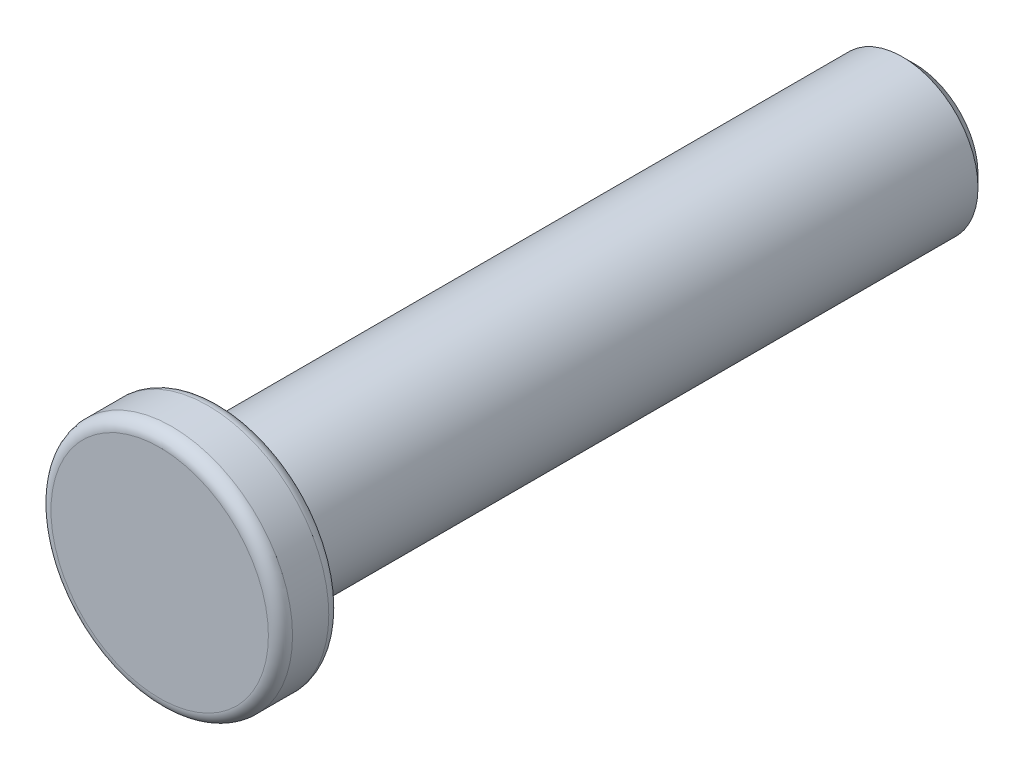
ISO-10303-21;
HEADER;
FILE_DESCRIPTION(('STEP AP214'),'2;1');
FILE_NAME('part.step','',(''),(''),'','','');
FILE_SCHEMA(('AUTOMOTIVE_DESIGN { 1 0 10303 214 1 1 1 1 }'));
ENDSEC;
DATA;
#1=APPLICATION_CONTEXT('core data for automotive mechanical design processes');
#2=APPLICATION_PROTOCOL_DEFINITION('international standard','automotive_design',2000,#1);
#3=PRODUCT_CONTEXT('',#1,'mechanical');
#4=PRODUCT('Part','Part','',(#3));
#5=PRODUCT_RELATED_PRODUCT_CATEGORY('part','',(#4));
#6=PRODUCT_DEFINITION_FORMATION('','',#4);
#7=PRODUCT_DEFINITION_CONTEXT('part definition',#1,'design');
#8=PRODUCT_DEFINITION('design','',#6,#7);
#9=PRODUCT_DEFINITION_SHAPE('','',#8);
#10=(LENGTH_UNIT() NAMED_UNIT(*) SI_UNIT(.MILLI.,.METRE.));
#11=(NAMED_UNIT(*) PLANE_ANGLE_UNIT() SI_UNIT($,.RADIAN.));
#12=(NAMED_UNIT(*) SI_UNIT($,.STERADIAN.) SOLID_ANGLE_UNIT());
#13=UNCERTAINTY_MEASURE_WITH_UNIT(LENGTH_MEASURE(1.E-05),#10,'distance_accuracy_value','');
#14=(GEOMETRIC_REPRESENTATION_CONTEXT(3) GLOBAL_UNCERTAINTY_ASSIGNED_CONTEXT((#13)) GLOBAL_UNIT_ASSIGNED_CONTEXT((#10,
#11,#12)) REPRESENTATION_CONTEXT('',''));
#15=CARTESIAN_POINT('',(0.,0.,0.));
#16=DIRECTION('',(0.,0.,1.));
#17=DIRECTION('',(1.,0.,0.));
#18=AXIS2_PLACEMENT_3D('',#15,#16,#17);
#19=CARTESIAN_POINT('',(0.,0.,12.5));
#20=DIRECTION('',(0.,0.,-1.));
#21=DIRECTION('',(-1.,0.,0.));
#22=AXIS2_PLACEMENT_3D('',#19,#20,#21);
#23=PLANE('',#22);
#24=CARTESIAN_POINT('',(0.,0.,12.5));
#25=DIRECTION('',(0.,0.,-1.));
#26=DIRECTION('',(1.,0.,0.));
#27=AXIS2_PLACEMENT_3D('',#24,#25,#26);
#28=CIRCLE('',#27,1.8);
#29=CARTESIAN_POINT('',(1.8,0.,12.5));
#30=VERTEX_POINT('',#29);
#31=EDGE_CURVE('E144',#30,#30,#28,.T.);
#32=ORIENTED_EDGE('',*,*,#31,.F.);
#33=EDGE_LOOP('',(#32));
#34=FACE_BOUND('',#33,.T.);
#35=ADVANCED_FACE('F13',(#34),#23,.F.);
#36=CARTESIAN_POINT('',(0.,0.,12.3));
#37=DIRECTION('',(0.,0.,-1.));
#38=DIRECTION('',(-1.,0.,0.));
#39=AXIS2_PLACEMENT_3D('',#36,#37,#38);
#40=TOROIDAL_SURFACE('',#39,1.8,0.2);
#41=CARTESIAN_POINT('',(0.,0.,12.3));
#42=DIRECTION('',(0.,0.,1.));
#43=DIRECTION('',(1.,0.,0.));
#44=AXIS2_PLACEMENT_3D('',#41,#42,#43);
#45=CIRCLE('',#44,2.);
#46=CARTESIAN_POINT('',(2.,0.,12.3));
#47=VERTEX_POINT('',#46);
#48=EDGE_CURVE('E67',#47,#47,#45,.F.);
#49=ORIENTED_EDGE('',*,*,#48,.F.);
#50=EDGE_LOOP('',(#49));
#51=FACE_BOUND('',#50,.T.);
#52=ORIENTED_EDGE('',*,*,#31,.T.);
#53=EDGE_LOOP('',(#52));
#54=FACE_BOUND('',#53,.T.);
#55=ADVANCED_FACE('F114',(#51,#54),#40,.T.);
#56=CARTESIAN_POINT('',(0.,0.,11.5));
#57=DIRECTION('',(0.,0.,1.));
#58=DIRECTION('',(1.,0.,0.));
#59=AXIS2_PLACEMENT_3D('',#56,#57,#58);
#60=CYLINDRICAL_SURFACE('',#59,2.);
#61=ORIENTED_EDGE('',*,*,#48,.T.);
#62=EDGE_LOOP('',(#61));
#63=FACE_BOUND('',#62,.T.);
#64=CARTESIAN_POINT('',(0.,0.,11.7));
#65=DIRECTION('',(0.,0.,-1.));
#66=DIRECTION('',(-1.,0.,0.));
#67=AXIS2_PLACEMENT_3D('',#64,#65,#66);
#68=CIRCLE('',#67,2.);
#69=CARTESIAN_POINT('',(-2.,0.,11.7));
#70=VERTEX_POINT('',#69);
#71=EDGE_CURVE('E64',#70,#70,#68,.T.);
#72=ORIENTED_EDGE('',*,*,#71,.F.);
#73=EDGE_LOOP('',(#72));
#74=FACE_BOUND('',#73,.T.);
#75=ADVANCED_FACE('F57',(#63,#74),#60,.T.);
#76=CARTESIAN_POINT('',(0.,0.,11.7));
#77=DIRECTION('',(0.,0.,-1.));
#78=DIRECTION('',(-1.,0.,0.));
#79=AXIS2_PLACEMENT_3D('',#76,#77,#78);
#80=TOROIDAL_SURFACE('',#79,1.8,0.2);
#81=CARTESIAN_POINT('',(0.,0.,11.5));
#82=DIRECTION('',(0.,0.,1.));
#83=DIRECTION('',(1.,0.,0.));
#84=AXIS2_PLACEMENT_3D('',#81,#82,#83);
#85=CIRCLE('',#84,1.8);
#86=CARTESIAN_POINT('',(1.8,0.,11.5));
#87=VERTEX_POINT('',#86);
#88=EDGE_CURVE('E38',#87,#87,#85,.F.);
#89=ORIENTED_EDGE('',*,*,#88,.F.);
#90=EDGE_LOOP('',(#89));
#91=FACE_BOUND('',#90,.T.);
#92=ORIENTED_EDGE('',*,*,#71,.T.);
#93=EDGE_LOOP('',(#92));
#94=FACE_BOUND('',#93,.T.);
#95=ADVANCED_FACE('F45',(#91,#94),#80,.T.);
#96=CARTESIAN_POINT('',(0.,0.,0.));
#97=DIRECTION('',(0.,0.,-1.));
#98=DIRECTION('',(-1.,0.,0.));
#99=AXIS2_PLACEMENT_3D('',#96,#97,#98);
#100=PLANE('',#99);
#101=CARTESIAN_POINT('',(0.,0.,-1.13686837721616E-10));
#102=DIRECTION('',(0.,0.,1.));
#103=DIRECTION('',(1.,0.,0.));
#104=AXIS2_PLACEMENT_3D('',#101,#102,#103);
#105=CIRCLE('',#104,1.05000000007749);
#106=CARTESIAN_POINT('',(1.05000000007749,0.,-1.13686837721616E-10));
#107=VERTEX_POINT('',#106);
#108=EDGE_CURVE('E17',#107,#107,#105,.T.);
#109=ORIENTED_EDGE('',*,*,#108,.F.);
#110=EDGE_LOOP('',(#109));
#111=FACE_BOUND('',#110,.T.);
#112=ADVANCED_FACE('F56',(#111),#100,.T.);
#113=CARTESIAN_POINT('',(0.,0.,11.5));
#114=DIRECTION('',(0.,0.,-1.));
#115=DIRECTION('',(-1.,0.,0.));
#116=AXIS2_PLACEMENT_3D('',#113,#114,#115);
#117=PLANE('',#116);
#118=CARTESIAN_POINT('',(0.,0.,11.5));
#119=DIRECTION('',(0.,0.,1.));
#120=DIRECTION('',(1.,0.,0.));
#121=AXIS2_PLACEMENT_3D('',#118,#119,#120);
#122=CIRCLE('',#121,1.25);
#123=CARTESIAN_POINT('',(1.25,0.,11.5));
#124=VERTEX_POINT('',#123);
#125=EDGE_CURVE('E21',#124,#124,#122,.F.);
#126=ORIENTED_EDGE('',*,*,#125,.F.);
#127=EDGE_LOOP('',(#126));
#128=FACE_BOUND('',#127,.T.);
#129=ORIENTED_EDGE('',*,*,#88,.T.);
#130=EDGE_LOOP('',(#129));
#131=FACE_BOUND('',#130,.T.);
#132=ADVANCED_FACE('F70',(#128,#131),#117,.T.);
#133=CARTESIAN_POINT('',(0.,0.,0.200000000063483));
#134=DIRECTION('',(0.,0.,1.));
#135=DIRECTION('',(1.,0.,0.));
#136=AXIS2_PLACEMENT_3D('',#133,#134,#135);
#137=CONICAL_SURFACE('',#136,1.24999999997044,0.785398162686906);
#138=ORIENTED_EDGE('',*,*,#108,.T.);
#139=EDGE_LOOP('',(#138));
#140=FACE_BOUND('',#139,.T.);
#141=CARTESIAN_POINT('',(0.,0.,0.2));
#142=DIRECTION('',(0.,0.,1.));
#143=DIRECTION('',(1.,0.,0.));
#144=AXIS2_PLACEMENT_3D('',#141,#142,#143);
#145=CIRCLE('',#144,1.25);
#146=CARTESIAN_POINT('',(1.25,0.,0.2));
#147=VERTEX_POINT('',#146);
#148=EDGE_CURVE('E9',#147,#147,#145,.T.);
#149=ORIENTED_EDGE('',*,*,#148,.F.);
#150=EDGE_LOOP('',(#149));
#151=FACE_BOUND('',#150,.T.);
#152=ADVANCED_FACE('F74',(#140,#151),#137,.T.);
#153=CARTESIAN_POINT('',(0.,0.,0.));
#154=DIRECTION('',(0.,0.,1.));
#155=DIRECTION('',(1.,0.,0.));
#156=AXIS2_PLACEMENT_3D('',#153,#154,#155);
#157=CYLINDRICAL_SURFACE('',#156,1.25);
#158=ORIENTED_EDGE('',*,*,#148,.T.);
#159=EDGE_LOOP('',(#158));
#160=FACE_BOUND('',#159,.T.);
#161=ORIENTED_EDGE('',*,*,#125,.T.);
#162=EDGE_LOOP('',(#161));
#163=FACE_BOUND('',#162,.T.);
#164=ADVANCED_FACE('F15',(#160,#163),#157,.T.);
#165=CLOSED_SHELL('',(#35,#55,#75,#95,#112,#132,#152,#164));
#166=MANIFOLD_SOLID_BREP('B1',#165);
#167=ADVANCED_BREP_SHAPE_REPRESENTATION('',(#18,#166),#14);
#168=SHAPE_DEFINITION_REPRESENTATION(#9,#167);
ENDSEC;
END-ISO-10303-21;
